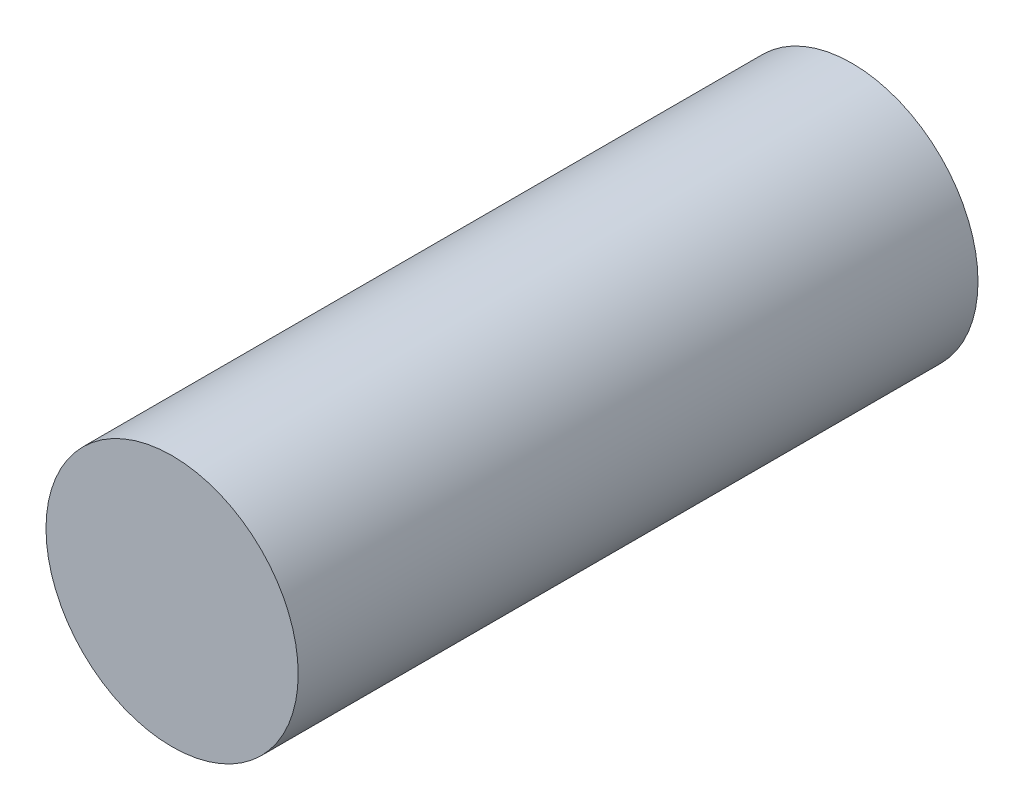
from build123d import *

# Parameters (mm, degrees)
SKIZZE1_R               = 57.5
LINEAR_AUSTRAGEN1_DEPTH = 310


with BuildPart() as part:
    # Skizze1 → Linear austragen1 (new body)
    with BuildSketch(Plane.XY):
        Circle(SKIZZE1_R)
    extrude(amount=LINEAR_AUSTRAGEN1_DEPTH)


solid = part.part
